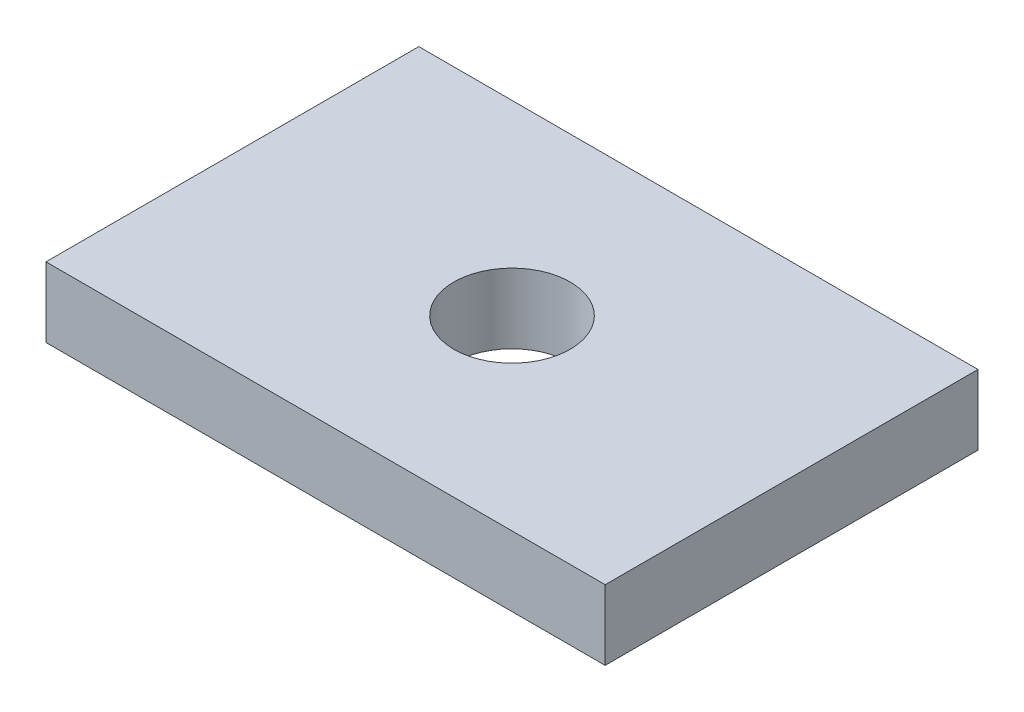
ISO-10303-21;
HEADER;
FILE_DESCRIPTION(('STEP AP214'),'2;1');
FILE_NAME('part.step','',(''),(''),'','','');
FILE_SCHEMA(('AUTOMOTIVE_DESIGN { 1 0 10303 214 1 1 1 1 }'));
ENDSEC;
DATA;
#1=APPLICATION_CONTEXT('core data for automotive mechanical design processes');
#2=APPLICATION_PROTOCOL_DEFINITION('international standard','automotive_design',2000,#1);
#3=PRODUCT_CONTEXT('',#1,'mechanical');
#4=PRODUCT('Part','Part','',(#3));
#5=PRODUCT_RELATED_PRODUCT_CATEGORY('part','',(#4));
#6=PRODUCT_DEFINITION_FORMATION('','',#4);
#7=PRODUCT_DEFINITION_CONTEXT('part definition',#1,'design');
#8=PRODUCT_DEFINITION('design','',#6,#7);
#9=PRODUCT_DEFINITION_SHAPE('','',#8);
#10=(LENGTH_UNIT() NAMED_UNIT(*) SI_UNIT(.MILLI.,.METRE.));
#11=(NAMED_UNIT(*) PLANE_ANGLE_UNIT() SI_UNIT($,.RADIAN.));
#12=(NAMED_UNIT(*) SI_UNIT($,.STERADIAN.) SOLID_ANGLE_UNIT());
#13=UNCERTAINTY_MEASURE_WITH_UNIT(LENGTH_MEASURE(1.E-05),#10,'distance_accuracy_value','');
#14=(GEOMETRIC_REPRESENTATION_CONTEXT(3) GLOBAL_UNCERTAINTY_ASSIGNED_CONTEXT((#13)) GLOBAL_UNIT_ASSIGNED_CONTEXT((#10,
#11,#12)) REPRESENTATION_CONTEXT('',''));
#15=CARTESIAN_POINT('',(0.,0.,0.));
#16=DIRECTION('',(0.,0.,1.));
#17=DIRECTION('',(1.,0.,0.));
#18=AXIS2_PLACEMENT_3D('',#15,#16,#17);
#19=CARTESIAN_POINT('',(0.,-15.,0.));
#20=DIRECTION('',(-1.,0.,0.));
#21=DIRECTION('',(0.,0.,1.));
#22=AXIS2_PLACEMENT_3D('',#19,#20,#21);
#23=PLANE('',#22);
#24=DIRECTION('',(0.,0.,1.));
#25=VECTOR('',#24,1.);
#26=CARTESIAN_POINT('',(0.,0.,0.));
#27=LINE('',#26,#25);
#28=CARTESIAN_POINT('',(0.,0.,-80.));
#29=VERTEX_POINT('',#28);
#30=CARTESIAN_POINT('',(0.,0.,0.));
#31=VERTEX_POINT('',#30);
#32=EDGE_CURVE('E106',#29,#31,#27,.T.);
#33=ORIENTED_EDGE('',*,*,#32,.F.);
#34=DIRECTION('',(0.,1.,0.));
#35=VECTOR('',#34,1.);
#36=CARTESIAN_POINT('',(0.,-15.,-80.));
#37=LINE('',#36,#35);
#38=CARTESIAN_POINT('',(0.,-15.,-80.));
#39=VERTEX_POINT('',#38);
#40=EDGE_CURVE('E11',#39,#29,#37,.T.);
#41=ORIENTED_EDGE('',*,*,#40,.F.);
#42=DIRECTION('',(0.,0.,1.));
#43=VECTOR('',#42,1.);
#44=CARTESIAN_POINT('',(0.,-15.,0.));
#45=LINE('',#44,#43);
#46=CARTESIAN_POINT('',(0.,-15.,0.));
#47=VERTEX_POINT('',#46);
#48=EDGE_CURVE('E97',#39,#47,#45,.T.);
#49=ORIENTED_EDGE('',*,*,#48,.T.);
#50=DIRECTION('',(0.,1.,0.));
#51=VECTOR('',#50,1.);
#52=CARTESIAN_POINT('',(0.,-15.,0.));
#53=LINE('',#52,#51);
#54=EDGE_CURVE('E42',#47,#31,#53,.T.);
#55=ORIENTED_EDGE('',*,*,#54,.T.);
#56=EDGE_LOOP('',(#33,#41,#49,#55));
#57=FACE_BOUND('',#56,.T.);
#58=ADVANCED_FACE('F41',(#57),#23,.T.);
#59=CARTESIAN_POINT('',(0.,-15.,-80.));
#60=DIRECTION('',(0.,0.,-1.));
#61=DIRECTION('',(-1.,0.,0.));
#62=AXIS2_PLACEMENT_3D('',#59,#60,#61);
#63=PLANE('',#62);
#64=DIRECTION('',(-1.,0.,0.));
#65=VECTOR('',#64,1.);
#66=CARTESIAN_POINT('',(0.,0.,-80.));
#67=LINE('',#66,#65);
#68=CARTESIAN_POINT('',(120.,0.,-80.));
#69=VERTEX_POINT('',#68);
#70=EDGE_CURVE('E101',#69,#29,#67,.T.);
#71=ORIENTED_EDGE('',*,*,#70,.F.);
#72=DIRECTION('',(0.,1.,0.));
#73=VECTOR('',#72,1.);
#74=CARTESIAN_POINT('',(120.,-15.,-80.));
#75=LINE('',#74,#73);
#76=CARTESIAN_POINT('',(120.,-15.,-80.));
#77=VERTEX_POINT('',#76);
#78=EDGE_CURVE('E49',#77,#69,#75,.T.);
#79=ORIENTED_EDGE('',*,*,#78,.F.);
#80=DIRECTION('',(-1.,0.,0.));
#81=VECTOR('',#80,1.);
#82=CARTESIAN_POINT('',(0.,-15.,-80.));
#83=LINE('',#82,#81);
#84=EDGE_CURVE('E96',#77,#39,#83,.T.);
#85=ORIENTED_EDGE('',*,*,#84,.T.);
#86=ORIENTED_EDGE('',*,*,#40,.T.);
#87=EDGE_LOOP('',(#71,#79,#85,#86));
#88=FACE_BOUND('',#87,.T.);
#89=ADVANCED_FACE('F119',(#88),#63,.T.);
#90=CARTESIAN_POINT('',(120.,-15.,0.));
#91=DIRECTION('',(1.,0.,0.));
#92=DIRECTION('',(0.,0.,-1.));
#93=AXIS2_PLACEMENT_3D('',#90,#91,#92);
#94=PLANE('',#93);
#95=DIRECTION('',(0.,0.,-1.));
#96=VECTOR('',#95,1.);
#97=CARTESIAN_POINT('',(120.,0.,0.));
#98=LINE('',#97,#96);
#99=CARTESIAN_POINT('',(120.,0.,0.));
#100=VERTEX_POINT('',#99);
#101=EDGE_CURVE('E93',#100,#69,#98,.T.);
#102=ORIENTED_EDGE('',*,*,#101,.F.);
#103=DIRECTION('',(0.,1.,0.));
#104=VECTOR('',#103,1.);
#105=CARTESIAN_POINT('',(120.,-15.,0.));
#106=LINE('',#105,#104);
#107=CARTESIAN_POINT('',(120.,-15.,0.));
#108=VERTEX_POINT('',#107);
#109=EDGE_CURVE('E88',#108,#100,#106,.T.);
#110=ORIENTED_EDGE('',*,*,#109,.F.);
#111=DIRECTION('',(0.,0.,-1.));
#112=VECTOR('',#111,1.);
#113=CARTESIAN_POINT('',(120.,-15.,0.));
#114=LINE('',#113,#112);
#115=EDGE_CURVE('E90',#108,#77,#114,.T.);
#116=ORIENTED_EDGE('',*,*,#115,.T.);
#117=ORIENTED_EDGE('',*,*,#78,.T.);
#118=EDGE_LOOP('',(#102,#110,#116,#117));
#119=FACE_BOUND('',#118,.T.);
#120=ADVANCED_FACE('F86',(#119),#94,.T.);
#121=CARTESIAN_POINT('',(0.,-15.,0.));
#122=DIRECTION('',(0.,0.,1.));
#123=DIRECTION('',(1.,0.,0.));
#124=AXIS2_PLACEMENT_3D('',#121,#122,#123);
#125=PLANE('',#124);
#126=DIRECTION('',(1.,0.,0.));
#127=VECTOR('',#126,1.);
#128=CARTESIAN_POINT('',(0.,0.,0.));
#129=LINE('',#128,#127);
#130=EDGE_CURVE('E108',#31,#100,#129,.T.);
#131=ORIENTED_EDGE('',*,*,#130,.F.);
#132=ORIENTED_EDGE('',*,*,#54,.F.);
#133=DIRECTION('',(1.,0.,0.));
#134=VECTOR('',#133,1.);
#135=CARTESIAN_POINT('',(0.,-15.,0.));
#136=LINE('',#135,#134);
#137=EDGE_CURVE('E92',#47,#108,#136,.T.);
#138=ORIENTED_EDGE('',*,*,#137,.T.);
#139=ORIENTED_EDGE('',*,*,#109,.T.);
#140=EDGE_LOOP('',(#131,#132,#138,#139));
#141=FACE_BOUND('',#140,.T.);
#142=ADVANCED_FACE('F98',(#141),#125,.T.);
#143=CARTESIAN_POINT('',(0.,-15.,0.));
#144=DIRECTION('',(0.,-1.,0.));
#145=DIRECTION('',(0.,0.,-1.));
#146=AXIS2_PLACEMENT_3D('',#143,#144,#145);
#147=PLANE('',#146);
#148=CARTESIAN_POINT('',(60.,-15.,-40.));
#149=DIRECTION('',(0.,1.,0.));
#150=DIRECTION('',(0.,0.,1.));
#151=AXIS2_PLACEMENT_3D('',#148,#149,#150);
#152=CIRCLE('',#151,12.5);
#153=CARTESIAN_POINT('',(60.,-15.,-27.5));
#154=VERTEX_POINT('',#153);
#155=EDGE_CURVE('E109',#154,#154,#152,.T.);
#156=ORIENTED_EDGE('',*,*,#155,.T.);
#157=EDGE_LOOP('',(#156));
#158=FACE_BOUND('',#157,.T.);
#159=ORIENTED_EDGE('',*,*,#48,.F.);
#160=ORIENTED_EDGE('',*,*,#84,.F.);
#161=ORIENTED_EDGE('',*,*,#115,.F.);
#162=ORIENTED_EDGE('',*,*,#137,.F.);
#163=EDGE_LOOP('',(#159,#160,#161,#162));
#164=FACE_BOUND('',#163,.T.);
#165=ADVANCED_FACE('F94',(#158,#164),#147,.T.);
#166=CARTESIAN_POINT('',(0.,0.,0.));
#167=DIRECTION('',(0.,-1.,0.));
#168=DIRECTION('',(0.,0.,-1.));
#169=AXIS2_PLACEMENT_3D('',#166,#167,#168);
#170=PLANE('',#169);
#171=CARTESIAN_POINT('',(60.,0.,-40.));
#172=DIRECTION('',(0.,1.,0.));
#173=DIRECTION('',(0.,0.,1.));
#174=AXIS2_PLACEMENT_3D('',#171,#172,#173);
#175=CIRCLE('',#174,12.5);
#176=CARTESIAN_POINT('',(60.,0.,-27.5));
#177=VERTEX_POINT('',#176);
#178=EDGE_CURVE('E150',#177,#177,#175,.T.);
#179=ORIENTED_EDGE('',*,*,#178,.F.);
#180=EDGE_LOOP('',(#179));
#181=FACE_BOUND('',#180,.T.);
#182=ORIENTED_EDGE('',*,*,#32,.T.);
#183=ORIENTED_EDGE('',*,*,#130,.T.);
#184=ORIENTED_EDGE('',*,*,#101,.T.);
#185=ORIENTED_EDGE('',*,*,#70,.T.);
#186=EDGE_LOOP('',(#182,#183,#184,#185));
#187=FACE_BOUND('',#186,.T.);
#188=ADVANCED_FACE('F118',(#181,#187),#170,.F.);
#189=CARTESIAN_POINT('',(60.,-15.,-40.));
#190=DIRECTION('',(0.,1.,0.));
#191=DIRECTION('',(0.,0.,1.));
#192=AXIS2_PLACEMENT_3D('',#189,#190,#191);
#193=CYLINDRICAL_SURFACE('',#192,12.5);
#194=ORIENTED_EDGE('',*,*,#155,.F.);
#195=EDGE_LOOP('',(#194));
#196=FACE_BOUND('',#195,.T.);
#197=ORIENTED_EDGE('',*,*,#178,.T.);
#198=EDGE_LOOP('',(#197));
#199=FACE_BOUND('',#198,.T.);
#200=ADVANCED_FACE('F131',(#196,#199),#193,.F.);
#201=CLOSED_SHELL('',(#58,#89,#120,#142,#165,#188,#200));
#202=MANIFOLD_SOLID_BREP('B2',#201);
#203=ADVANCED_BREP_SHAPE_REPRESENTATION('',(#18,#202),#14);
#204=SHAPE_DEFINITION_REPRESENTATION(#9,#203);
ENDSEC;
END-ISO-10303-21;
